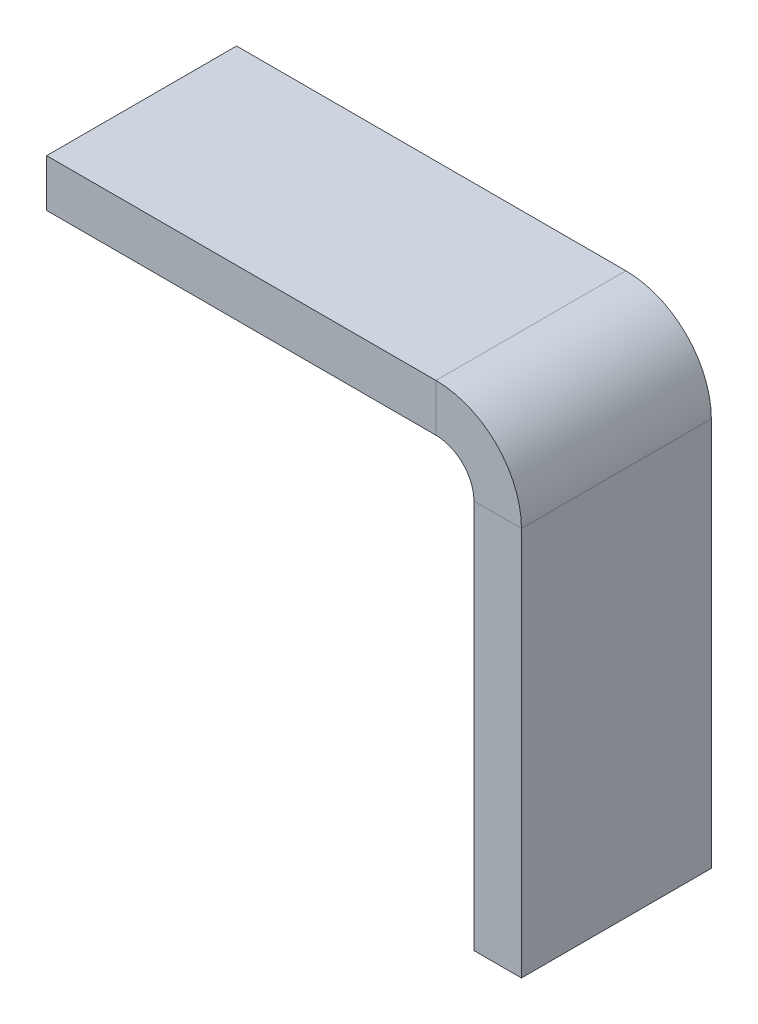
ISO-10303-21;
HEADER;
FILE_DESCRIPTION(('STEP AP214'),'2;1');
FILE_NAME('part.step','',(''),(''),'','','');
FILE_SCHEMA(('AUTOMOTIVE_DESIGN { 1 0 10303 214 1 1 1 1 }'));
ENDSEC;
DATA;
#1=APPLICATION_CONTEXT('core data for automotive mechanical design processes');
#2=APPLICATION_PROTOCOL_DEFINITION('international standard','automotive_design',2000,#1);
#3=PRODUCT_CONTEXT('',#1,'mechanical');
#4=PRODUCT('Part','Part','',(#3));
#5=PRODUCT_RELATED_PRODUCT_CATEGORY('part','',(#4));
#6=PRODUCT_DEFINITION_FORMATION('','',#4);
#7=PRODUCT_DEFINITION_CONTEXT('part definition',#1,'design');
#8=PRODUCT_DEFINITION('design','',#6,#7);
#9=PRODUCT_DEFINITION_SHAPE('','',#8);
#10=(LENGTH_UNIT() NAMED_UNIT(*) SI_UNIT(.MILLI.,.METRE.));
#11=(NAMED_UNIT(*) PLANE_ANGLE_UNIT() SI_UNIT($,.RADIAN.));
#12=(NAMED_UNIT(*) SI_UNIT($,.STERADIAN.) SOLID_ANGLE_UNIT());
#13=UNCERTAINTY_MEASURE_WITH_UNIT(LENGTH_MEASURE(1.E-05),#10,'distance_accuracy_value','');
#14=(GEOMETRIC_REPRESENTATION_CONTEXT(3) GLOBAL_UNCERTAINTY_ASSIGNED_CONTEXT((#13)) GLOBAL_UNIT_ASSIGNED_CONTEXT((#10,
#11,#12)) REPRESENTATION_CONTEXT('',''));
#15=CARTESIAN_POINT('',(0.,0.,0.));
#16=DIRECTION('',(0.,0.,1.));
#17=DIRECTION('',(1.,0.,0.));
#18=AXIS2_PLACEMENT_3D('',#15,#16,#17);
#19=CARTESIAN_POINT('',(0.,-9.00000000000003,20.));
#20=DIRECTION('',(0.,0.,1.));
#21=DIRECTION('',(1.,0.,0.));
#22=AXIS2_PLACEMENT_3D('',#19,#20,#21);
#23=PLANE('',#22);
#24=DIRECTION('',(-1.,0.,0.));
#25=VECTOR('',#24,1.);
#26=CARTESIAN_POINT('',(0.,-9.00000000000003,20.));
#27=LINE('',#26,#25);
#28=CARTESIAN_POINT('',(0.,-9.00000000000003,20.));
#29=VERTEX_POINT('',#28);
#30=CARTESIAN_POINT('',(-5.00000000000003,-9.00000000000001,20.));
#31=VERTEX_POINT('',#30);
#32=EDGE_CURVE('E11',#29,#31,#27,.T.);
#33=ORIENTED_EDGE('',*,*,#32,.F.);
#34=CARTESIAN_POINT('',(-9.00000000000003,-9.,20.));
#35=DIRECTION('',(0.,0.,1.));
#36=DIRECTION('',(1.,0.,0.));
#37=AXIS2_PLACEMENT_3D('',#34,#35,#36);
#38=CIRCLE('',#37,9.);
#39=CARTESIAN_POINT('',(-9.00000000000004,0.,20.));
#40=VERTEX_POINT('',#39);
#41=EDGE_CURVE('E133',#40,#29,#38,.F.);
#42=ORIENTED_EDGE('',*,*,#41,.F.);
#43=DIRECTION('',(0.,1.,0.));
#44=VECTOR('',#43,1.);
#45=CARTESIAN_POINT('',(-9.00000000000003,-5.,20.));
#46=LINE('',#45,#44);
#47=CARTESIAN_POINT('',(-9.00000000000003,-5.,20.));
#48=VERTEX_POINT('',#47);
#49=EDGE_CURVE('E44',#48,#40,#46,.T.);
#50=ORIENTED_EDGE('',*,*,#49,.F.);
#51=CARTESIAN_POINT('',(-9.00000000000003,-9.,20.));
#52=DIRECTION('',(0.,0.,1.));
#53=DIRECTION('',(1.,0.,0.));
#54=AXIS2_PLACEMENT_3D('',#51,#52,#53);
#55=CIRCLE('',#54,4.);
#56=EDGE_CURVE('E126',#48,#31,#55,.F.);
#57=ORIENTED_EDGE('',*,*,#56,.T.);
#58=EDGE_LOOP('',(#33,#42,#50,#57));
#59=FACE_BOUND('',#58,.T.);
#60=ADVANCED_FACE('F36',(#59),#23,.T.);
#61=CARTESIAN_POINT('',(-9.00000000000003,-5.,20.));
#62=DIRECTION('',(0.,0.,1.));
#63=DIRECTION('',(1.,0.,0.));
#64=AXIS2_PLACEMENT_3D('',#61,#62,#63);
#65=PLANE('',#64);
#66=DIRECTION('',(0.,-1.,0.));
#67=VECTOR('',#66,1.);
#68=CARTESIAN_POINT('',(0.,0.,20.));
#69=LINE('',#68,#67);
#70=CARTESIAN_POINT('',(-1.74860126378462E-13,-50.,20.));
#71=VERTEX_POINT('',#70);
#72=EDGE_CURVE('E182',#29,#71,#69,.T.);
#73=ORIENTED_EDGE('',*,*,#72,.F.);
#74=ORIENTED_EDGE('',*,*,#32,.T.);
#75=DIRECTION('',(0.,-1.,0.));
#76=VECTOR('',#75,1.);
#77=CARTESIAN_POINT('',(-5.,0.,20.));
#78=LINE('',#77,#76);
#79=CARTESIAN_POINT('',(-5.00000000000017,-50.,20.));
#80=VERTEX_POINT('',#79);
#81=EDGE_CURVE('E92',#31,#80,#78,.T.);
#82=ORIENTED_EDGE('',*,*,#81,.T.);
#83=DIRECTION('',(-1.,0.,0.));
#84=VECTOR('',#83,1.);
#85=CARTESIAN_POINT('',(-1.74860126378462E-13,-50.,20.));
#86=LINE('',#85,#84);
#87=EDGE_CURVE('E339',#71,#80,#86,.T.);
#88=ORIENTED_EDGE('',*,*,#87,.F.);
#89=EDGE_LOOP('',(#73,#74,#82,#88));
#90=FACE_BOUND('',#89,.T.);
#91=ADVANCED_FACE('F190',(#90),#65,.T.);
#92=CARTESIAN_POINT('',(-9.00000000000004,0.,0.));
#93=DIRECTION('',(0.,0.,-1.));
#94=DIRECTION('',(-1.,0.,0.));
#95=AXIS2_PLACEMENT_3D('',#92,#93,#94);
#96=PLANE('',#95);
#97=DIRECTION('',(0.,-1.,0.));
#98=VECTOR('',#97,1.);
#99=CARTESIAN_POINT('',(-9.00000000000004,0.,0.));
#100=LINE('',#99,#98);
#101=CARTESIAN_POINT('',(-9.00000000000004,0.,0.));
#102=VERTEX_POINT('',#101);
#103=CARTESIAN_POINT('',(-9.00000000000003,-5.,0.));
#104=VERTEX_POINT('',#103);
#105=EDGE_CURVE('E79',#102,#104,#100,.T.);
#106=ORIENTED_EDGE('',*,*,#105,.F.);
#107=CARTESIAN_POINT('',(-9.00000000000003,-9.,0.));
#108=DIRECTION('',(0.,0.,1.));
#109=DIRECTION('',(1.,0.,0.));
#110=AXIS2_PLACEMENT_3D('',#107,#108,#109);
#111=CIRCLE('',#110,9.);
#112=CARTESIAN_POINT('',(0.,-9.00000000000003,0.));
#113=VERTEX_POINT('',#112);
#114=EDGE_CURVE('E148',#102,#113,#111,.F.);
#115=ORIENTED_EDGE('',*,*,#114,.T.);
#116=DIRECTION('',(1.,0.,0.));
#117=VECTOR('',#116,1.);
#118=CARTESIAN_POINT('',(-5.00000000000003,-9.00000000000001,0.));
#119=LINE('',#118,#117);
#120=CARTESIAN_POINT('',(-5.00000000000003,-9.00000000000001,0.));
#121=VERTEX_POINT('',#120);
#122=EDGE_CURVE('E86',#121,#113,#119,.T.);
#123=ORIENTED_EDGE('',*,*,#122,.F.);
#124=CARTESIAN_POINT('',(-9.00000000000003,-9.,0.));
#125=DIRECTION('',(0.,0.,1.));
#126=DIRECTION('',(1.,0.,0.));
#127=AXIS2_PLACEMENT_3D('',#124,#125,#126);
#128=CIRCLE('',#127,4.);
#129=EDGE_CURVE('E155',#104,#121,#128,.F.);
#130=ORIENTED_EDGE('',*,*,#129,.F.);
#131=EDGE_LOOP('',(#106,#115,#123,#130));
#132=FACE_BOUND('',#131,.T.);
#133=ADVANCED_FACE('F188',(#132),#96,.T.);
#134=CARTESIAN_POINT('',(-5.00000000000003,-9.00000000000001,0.));
#135=DIRECTION('',(0.,0.,-1.));
#136=DIRECTION('',(-1.,0.,0.));
#137=AXIS2_PLACEMENT_3D('',#134,#135,#136);
#138=PLANE('',#137);
#139=DIRECTION('',(1.,0.,0.));
#140=VECTOR('',#139,1.);
#141=CARTESIAN_POINT('',(-50.,0.,0.));
#142=LINE('',#141,#140);
#143=CARTESIAN_POINT('',(-50.,0.,0.));
#144=VERTEX_POINT('',#143);
#145=EDGE_CURVE('E150',#144,#102,#142,.T.);
#146=ORIENTED_EDGE('',*,*,#145,.T.);
#147=ORIENTED_EDGE('',*,*,#105,.T.);
#148=DIRECTION('',(1.,0.,0.));
#149=VECTOR('',#148,1.);
#150=CARTESIAN_POINT('',(-50.,-5.,0.));
#151=LINE('',#150,#149);
#152=CARTESIAN_POINT('',(-50.,-5.,0.));
#153=VERTEX_POINT('',#152);
#154=EDGE_CURVE('E153',#153,#104,#151,.T.);
#155=ORIENTED_EDGE('',*,*,#154,.F.);
#156=DIRECTION('',(0.,1.,0.));
#157=VECTOR('',#156,1.);
#158=CARTESIAN_POINT('',(-50.,-5.,0.));
#159=LINE('',#158,#157);
#160=EDGE_CURVE('E114',#153,#144,#159,.T.);
#161=ORIENTED_EDGE('',*,*,#160,.T.);
#162=EDGE_LOOP('',(#146,#147,#155,#161));
#163=FACE_BOUND('',#162,.T.);
#164=ADVANCED_FACE('F184',(#163),#138,.T.);
#165=CARTESIAN_POINT('',(-5.,0.,20.));
#166=DIRECTION('',(1.,0.,0.));
#167=DIRECTION('',(0.,1.,0.));
#168=AXIS2_PLACEMENT_3D('',#165,#166,#167);
#169=PLANE('',#168);
#170=DIRECTION('',(0.,-1.,0.));
#171=VECTOR('',#170,1.);
#172=CARTESIAN_POINT('',(-5.,0.,0.));
#173=LINE('',#172,#171);
#174=CARTESIAN_POINT('',(-5.00000000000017,-50.,0.));
#175=VERTEX_POINT('',#174);
#176=EDGE_CURVE('E139',#121,#175,#173,.T.);
#177=ORIENTED_EDGE('',*,*,#176,.T.);
#178=DIRECTION('',(0.,0.,-1.));
#179=VECTOR('',#178,1.);
#180=CARTESIAN_POINT('',(-5.00000000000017,-50.,20.));
#181=LINE('',#180,#179);
#182=EDGE_CURVE('E169',#80,#175,#181,.T.);
#183=ORIENTED_EDGE('',*,*,#182,.F.);
#184=ORIENTED_EDGE('',*,*,#81,.F.);
#185=DIRECTION('',(0.,0.,-1.));
#186=VECTOR('',#185,1.);
#187=CARTESIAN_POINT('',(-5.00000000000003,-9.00000000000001,20.));
#188=LINE('',#187,#186);
#189=EDGE_CURVE('E138',#31,#121,#188,.T.);
#190=ORIENTED_EDGE('',*,*,#189,.T.);
#191=EDGE_LOOP('',(#177,#183,#184,#190));
#192=FACE_BOUND('',#191,.T.);
#193=ADVANCED_FACE('F196',(#192),#169,.F.);
#194=CARTESIAN_POINT('',(-1.74860126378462E-13,-50.,20.));
#195=DIRECTION('',(0.,-1.,0.));
#196=DIRECTION('',(1.,0.,0.));
#197=AXIS2_PLACEMENT_3D('',#194,#195,#196);
#198=PLANE('',#197);
#199=DIRECTION('',(-1.,0.,0.));
#200=VECTOR('',#199,1.);
#201=CARTESIAN_POINT('',(-1.74860126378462E-13,-50.,0.));
#202=LINE('',#201,#200);
#203=CARTESIAN_POINT('',(-1.74860126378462E-13,-50.,0.));
#204=VERTEX_POINT('',#203);
#205=EDGE_CURVE('E142',#204,#175,#202,.T.);
#206=ORIENTED_EDGE('',*,*,#205,.F.);
#207=DIRECTION('',(0.,0.,-1.));
#208=VECTOR('',#207,1.);
#209=CARTESIAN_POINT('',(-1.74860126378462E-13,-50.,20.));
#210=LINE('',#209,#208);
#211=EDGE_CURVE('E167',#71,#204,#210,.T.);
#212=ORIENTED_EDGE('',*,*,#211,.F.);
#213=ORIENTED_EDGE('',*,*,#87,.T.);
#214=ORIENTED_EDGE('',*,*,#182,.T.);
#215=EDGE_LOOP('',(#206,#212,#213,#214));
#216=FACE_BOUND('',#215,.T.);
#217=ADVANCED_FACE('F227',(#216),#198,.T.);
#218=CARTESIAN_POINT('',(0.,0.,20.));
#219=DIRECTION('',(1.,0.,0.));
#220=DIRECTION('',(0.,1.,0.));
#221=AXIS2_PLACEMENT_3D('',#218,#219,#220);
#222=PLANE('',#221);
#223=DIRECTION('',(0.,-1.,0.));
#224=VECTOR('',#223,1.);
#225=CARTESIAN_POINT('',(0.,0.,0.));
#226=LINE('',#225,#224);
#227=EDGE_CURVE('E145',#113,#204,#226,.T.);
#228=ORIENTED_EDGE('',*,*,#227,.F.);
#229=DIRECTION('',(0.,0.,-1.));
#230=VECTOR('',#229,1.);
#231=CARTESIAN_POINT('',(0.,-9.00000000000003,20.));
#232=LINE('',#231,#230);
#233=EDGE_CURVE('E164',#29,#113,#232,.T.);
#234=ORIENTED_EDGE('',*,*,#233,.F.);
#235=ORIENTED_EDGE('',*,*,#72,.T.);
#236=ORIENTED_EDGE('',*,*,#211,.T.);
#237=EDGE_LOOP('',(#228,#234,#235,#236));
#238=FACE_BOUND('',#237,.T.);
#239=ADVANCED_FACE('F238',(#238),#222,.T.);
#240=CARTESIAN_POINT('',(-9.00000000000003,-9.,20.));
#241=DIRECTION('',(0.,0.,-1.));
#242=DIRECTION('',(-1.,0.,0.));
#243=AXIS2_PLACEMENT_3D('',#240,#241,#242);
#244=CYLINDRICAL_SURFACE('',#243,9.);
#245=ORIENTED_EDGE('',*,*,#114,.F.);
#246=DIRECTION('',(0.,0.,-1.));
#247=VECTOR('',#246,1.);
#248=CARTESIAN_POINT('',(-9.00000000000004,0.,20.));
#249=LINE('',#248,#247);
#250=EDGE_CURVE('E161',#40,#102,#249,.T.);
#251=ORIENTED_EDGE('',*,*,#250,.F.);
#252=ORIENTED_EDGE('',*,*,#41,.T.);
#253=ORIENTED_EDGE('',*,*,#233,.T.);
#254=EDGE_LOOP('',(#245,#251,#252,#253));
#255=FACE_BOUND('',#254,.T.);
#256=ADVANCED_FACE('F178',(#255),#244,.T.);
#257=CARTESIAN_POINT('',(-50.,0.,20.));
#258=DIRECTION('',(0.,1.,0.));
#259=DIRECTION('',(0.,0.,1.));
#260=AXIS2_PLACEMENT_3D('',#257,#258,#259);
#261=PLANE('',#260);
#262=ORIENTED_EDGE('',*,*,#145,.F.);
#263=DIRECTION('',(0.,0.,-1.));
#264=VECTOR('',#263,1.);
#265=CARTESIAN_POINT('',(-50.,0.,20.));
#266=LINE('',#265,#264);
#267=CARTESIAN_POINT('',(-50.,0.,20.));
#268=VERTEX_POINT('',#267);
#269=EDGE_CURVE('E116',#268,#144,#266,.T.);
#270=ORIENTED_EDGE('',*,*,#269,.F.);
#271=DIRECTION('',(1.,0.,0.));
#272=VECTOR('',#271,1.);
#273=CARTESIAN_POINT('',(-50.,0.,20.));
#274=LINE('',#273,#272);
#275=EDGE_CURVE('E131',#268,#40,#274,.T.);
#276=ORIENTED_EDGE('',*,*,#275,.T.);
#277=ORIENTED_EDGE('',*,*,#250,.T.);
#278=EDGE_LOOP('',(#262,#270,#276,#277));
#279=FACE_BOUND('',#278,.T.);
#280=ADVANCED_FACE('F183',(#279),#261,.T.);
#281=CARTESIAN_POINT('',(-50.,-5.,20.));
#282=DIRECTION('',(-1.,0.,0.));
#283=DIRECTION('',(0.,0.,1.));
#284=AXIS2_PLACEMENT_3D('',#281,#282,#283);
#285=PLANE('',#284);
#286=ORIENTED_EDGE('',*,*,#160,.F.);
#287=DIRECTION('',(0.,0.,-1.));
#288=VECTOR('',#287,1.);
#289=CARTESIAN_POINT('',(-50.,-5.,20.));
#290=LINE('',#289,#288);
#291=CARTESIAN_POINT('',(-50.,-5.,20.));
#292=VERTEX_POINT('',#291);
#293=EDGE_CURVE('E108',#292,#153,#290,.T.);
#294=ORIENTED_EDGE('',*,*,#293,.F.);
#295=DIRECTION('',(0.,1.,0.));
#296=VECTOR('',#295,1.);
#297=CARTESIAN_POINT('',(-50.,-5.,20.));
#298=LINE('',#297,#296);
#299=EDGE_CURVE('E112',#292,#268,#298,.T.);
#300=ORIENTED_EDGE('',*,*,#299,.T.);
#301=ORIENTED_EDGE('',*,*,#269,.T.);
#302=EDGE_LOOP('',(#286,#294,#300,#301));
#303=FACE_BOUND('',#302,.T.);
#304=ADVANCED_FACE('F110',(#303),#285,.T.);
#305=CARTESIAN_POINT('',(-50.,-5.,20.));
#306=DIRECTION('',(0.,1.,0.));
#307=DIRECTION('',(0.,0.,1.));
#308=AXIS2_PLACEMENT_3D('',#305,#306,#307);
#309=PLANE('',#308);
#310=ORIENTED_EDGE('',*,*,#154,.T.);
#311=DIRECTION('',(0.,0.,-1.));
#312=VECTOR('',#311,1.);
#313=CARTESIAN_POINT('',(-9.00000000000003,-5.,20.));
#314=LINE('',#313,#312);
#315=EDGE_CURVE('E117',#48,#104,#314,.T.);
#316=ORIENTED_EDGE('',*,*,#315,.F.);
#317=DIRECTION('',(1.,0.,0.));
#318=VECTOR('',#317,1.);
#319=CARTESIAN_POINT('',(-50.,-5.,20.));
#320=LINE('',#319,#318);
#321=EDGE_CURVE('E121',#292,#48,#320,.T.);
#322=ORIENTED_EDGE('',*,*,#321,.F.);
#323=ORIENTED_EDGE('',*,*,#293,.T.);
#324=EDGE_LOOP('',(#310,#316,#322,#323));
#325=FACE_BOUND('',#324,.T.);
#326=ADVANCED_FACE('F122',(#325),#309,.F.);
#327=CARTESIAN_POINT('',(-9.00000000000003,-9.,20.));
#328=DIRECTION('',(0.,0.,-1.));
#329=DIRECTION('',(-1.,0.,0.));
#330=AXIS2_PLACEMENT_3D('',#327,#328,#329);
#331=CYLINDRICAL_SURFACE('',#330,4.);
#332=ORIENTED_EDGE('',*,*,#129,.T.);
#333=ORIENTED_EDGE('',*,*,#189,.F.);
#334=ORIENTED_EDGE('',*,*,#56,.F.);
#335=ORIENTED_EDGE('',*,*,#315,.T.);
#336=EDGE_LOOP('',(#332,#333,#334,#335));
#337=FACE_BOUND('',#336,.T.);
#338=ADVANCED_FACE('F186',(#337),#331,.F.);
#339=CARTESIAN_POINT('',(-9.00000000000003,-9.,20.));
#340=DIRECTION('',(0.,0.,1.));
#341=DIRECTION('',(1.,0.,0.));
#342=AXIS2_PLACEMENT_3D('',#339,#340,#341);
#343=PLANE('',#342);
#344=ORIENTED_EDGE('',*,*,#321,.T.);
#345=ORIENTED_EDGE('',*,*,#49,.T.);
#346=ORIENTED_EDGE('',*,*,#275,.F.);
#347=ORIENTED_EDGE('',*,*,#299,.F.);
#348=EDGE_LOOP('',(#344,#345,#346,#347));
#349=FACE_BOUND('',#348,.T.);
#350=ADVANCED_FACE('F129',(#349),#343,.T.);
#351=CARTESIAN_POINT('',(-9.00000000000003,-9.,0.));
#352=DIRECTION('',(0.,0.,1.));
#353=DIRECTION('',(1.,0.,0.));
#354=AXIS2_PLACEMENT_3D('',#351,#352,#353);
#355=PLANE('',#354);
#356=ORIENTED_EDGE('',*,*,#176,.F.);
#357=ORIENTED_EDGE('',*,*,#122,.T.);
#358=ORIENTED_EDGE('',*,*,#227,.T.);
#359=ORIENTED_EDGE('',*,*,#205,.T.);
#360=EDGE_LOOP('',(#356,#357,#358,#359));
#361=FACE_BOUND('',#360,.T.);
#362=ADVANCED_FACE('F304',(#361),#355,.F.);
#363=CLOSED_SHELL('',(#60,#91,#133,#164,#193,#217,#239,#256,#280,#304,#326,#338,#350,#362));
#364=MANIFOLD_SOLID_BREP('B2',#363);
#365=ADVANCED_BREP_SHAPE_REPRESENTATION('',(#18,#364),#14);
#366=SHAPE_DEFINITION_REPRESENTATION(#9,#365);
ENDSEC;
END-ISO-10303-21;
